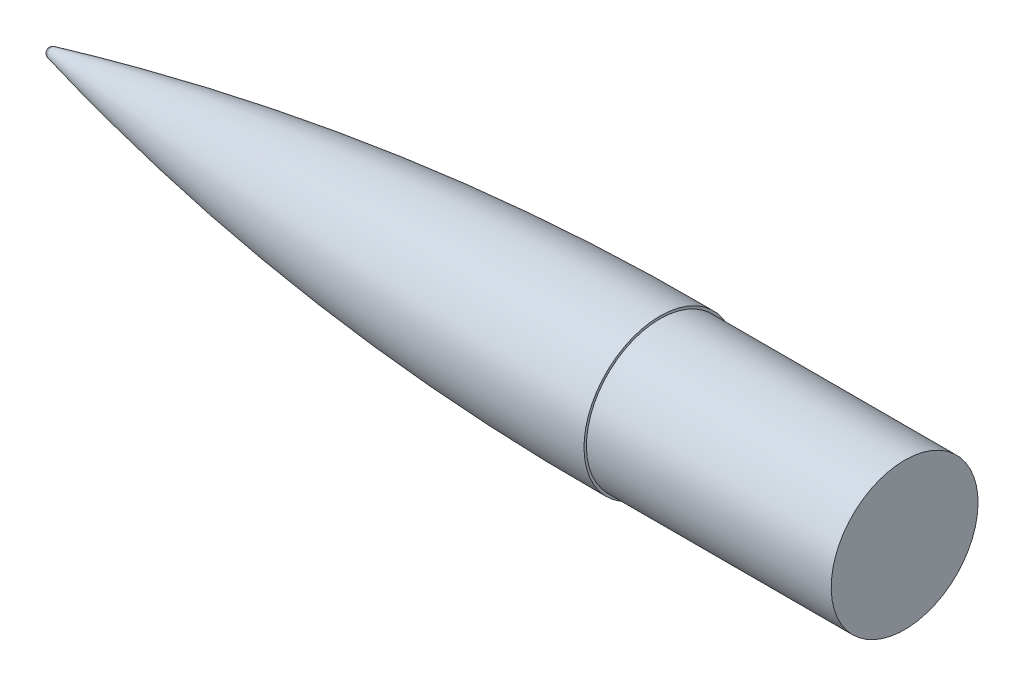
ISO-10303-21;
HEADER;
FILE_DESCRIPTION(('STEP AP214'),'2;1');
FILE_NAME('part.step','',(''),(''),'','','');
FILE_SCHEMA(('AUTOMOTIVE_DESIGN { 1 0 10303 214 1 1 1 1 }'));
ENDSEC;
DATA;
#1=APPLICATION_CONTEXT('core data for automotive mechanical design processes');
#2=APPLICATION_PROTOCOL_DEFINITION('international standard','automotive_design',2000,#1);
#3=PRODUCT_CONTEXT('',#1,'mechanical');
#4=PRODUCT('Part','Part','',(#3));
#5=PRODUCT_RELATED_PRODUCT_CATEGORY('part','',(#4));
#6=PRODUCT_DEFINITION_FORMATION('','',#4);
#7=PRODUCT_DEFINITION_CONTEXT('part definition',#1,'design');
#8=PRODUCT_DEFINITION('design','',#6,#7);
#9=PRODUCT_DEFINITION_SHAPE('','',#8);
#10=(LENGTH_UNIT() NAMED_UNIT(*) SI_UNIT(.MILLI.,.METRE.));
#11=(NAMED_UNIT(*) PLANE_ANGLE_UNIT() SI_UNIT($,.RADIAN.));
#12=(NAMED_UNIT(*) SI_UNIT($,.STERADIAN.) SOLID_ANGLE_UNIT());
#13=UNCERTAINTY_MEASURE_WITH_UNIT(LENGTH_MEASURE(1.E-05),#10,'distance_accuracy_value','');
#14=(GEOMETRIC_REPRESENTATION_CONTEXT(3) GLOBAL_UNCERTAINTY_ASSIGNED_CONTEXT((#13)) GLOBAL_UNIT_ASSIGNED_CONTEXT((#10,
#11,#12)) REPRESENTATION_CONTEXT('',''));
#15=CARTESIAN_POINT('',(0.,0.,0.));
#16=DIRECTION('',(0.,0.,1.));
#17=DIRECTION('',(1.,0.,0.));
#18=AXIS2_PLACEMENT_3D('',#15,#16,#17);
#19=CARTESIAN_POINT('',(317.693317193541,0.,0.));
#20=DIRECTION('',(1.,0.,0.));
#21=DIRECTION('',(0.,1.,0.));
#22=AXIS2_PLACEMENT_3D('',#19,#20,#21);
#23=DEGENERATE_TOROIDAL_SURFACE('',#22,1261.33745347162,1300.73103112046,.F.);
#24=CARTESIAN_POINT('',(9.96412339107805,0.,0.));
#25=DIRECTION('',(1.,0.,0.));
#26=DIRECTION('',(0.,1.,0.));
#27=AXIS2_PLACEMENT_3D('',#24,#25,#26);
#28=CIRCLE('',#27,2.46789491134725);
#29=CARTESIAN_POINT('',(9.96412339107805,2.46789491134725,0.));
#30=VERTEX_POINT('',#29);
#31=EDGE_CURVE('E10',#30,#30,#28,.T.);
#32=ORIENTED_EDGE('',*,*,#31,.T.);
#33=EDGE_LOOP('',(#32));
#34=FACE_BOUND('',#33,.T.);
#35=CARTESIAN_POINT('',(325.525034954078,0.,0.));
#36=DIRECTION('',(1.,0.,0.));
#37=DIRECTION('',(0.,1.,0.));
#38=AXIS2_PLACEMENT_3D('',#35,#36,#37);
#39=CIRCLE('',#38,39.37);
#40=CARTESIAN_POINT('',(325.525034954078,39.37,0.));
#41=VERTEX_POINT('',#40);
#42=EDGE_CURVE('E44',#41,#41,#39,.T.);
#43=ORIENTED_EDGE('',*,*,#42,.F.);
#44=EDGE_LOOP('',(#43));
#45=FACE_BOUND('',#44,.T.);
#46=ADVANCED_FACE('F30',(#34,#45),#23,.F.);
#47=CARTESIAN_POINT('',(10.5650349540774,0.,0.));
#48=DIRECTION('',(1.,0.,0.));
#49=DIRECTION('',(0.,1.,0.));
#50=AXIS2_PLACEMENT_3D('',#47,#48,#49);
#51=SPHERICAL_SURFACE('',#50,2.54);
#52=ORIENTED_EDGE('',*,*,#31,.F.);
#53=EDGE_LOOP('',(#52));
#54=FACE_BOUND('',#53,.T.);
#55=ADVANCED_FACE('F54',(#54),#51,.T.);
#56=CARTESIAN_POINT('',(452.525034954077,38.1,0.));
#57=DIRECTION('',(1.,0.,0.));
#58=DIRECTION('',(0.,1.,0.));
#59=AXIS2_PLACEMENT_3D('',#56,#57,#58);
#60=PLANE('',#59);
#61=CARTESIAN_POINT('',(452.525034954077,0.,0.));
#62=DIRECTION('',(1.,0.,0.));
#63=DIRECTION('',(0.,1.,0.));
#64=AXIS2_PLACEMENT_3D('',#61,#62,#63);
#65=CIRCLE('',#64,38.1);
#66=CARTESIAN_POINT('',(452.525034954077,38.1,0.));
#67=VERTEX_POINT('',#66);
#68=EDGE_CURVE('E36',#67,#67,#65,.T.);
#69=ORIENTED_EDGE('',*,*,#68,.T.);
#70=EDGE_LOOP('',(#69));
#71=FACE_BOUND('',#70,.T.);
#72=ADVANCED_FACE('F58',(#71),#60,.T.);
#73=CARTESIAN_POINT('',(452.525034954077,0.,0.));
#74=DIRECTION('',(1.,0.,0.));
#75=DIRECTION('',(0.,1.,0.));
#76=AXIS2_PLACEMENT_3D('',#73,#74,#75);
#77=CYLINDRICAL_SURFACE('',#76,38.1);
#78=CARTESIAN_POINT('',(325.525034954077,0.,0.));
#79=DIRECTION('',(1.,0.,0.));
#80=DIRECTION('',(0.,1.,0.));
#81=AXIS2_PLACEMENT_3D('',#78,#79,#80);
#82=CIRCLE('',#81,38.1);
#83=CARTESIAN_POINT('',(325.525034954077,38.1,0.));
#84=VERTEX_POINT('',#83);
#85=EDGE_CURVE('E40',#84,#84,#82,.T.);
#86=ORIENTED_EDGE('',*,*,#85,.T.);
#87=EDGE_LOOP('',(#86));
#88=FACE_BOUND('',#87,.T.);
#89=ORIENTED_EDGE('',*,*,#68,.F.);
#90=EDGE_LOOP('',(#89));
#91=FACE_BOUND('',#90,.T.);
#92=ADVANCED_FACE('F63',(#88,#91),#77,.T.);
#93=CARTESIAN_POINT('',(325.525034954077,38.1,0.));
#94=DIRECTION('',(1.,0.,0.));
#95=DIRECTION('',(0.,1.,0.));
#96=AXIS2_PLACEMENT_3D('',#93,#94,#95);
#97=PLANE('',#96);
#98=ORIENTED_EDGE('',*,*,#42,.T.);
#99=EDGE_LOOP('',(#98));
#100=FACE_BOUND('',#99,.T.);
#101=ORIENTED_EDGE('',*,*,#85,.F.);
#102=EDGE_LOOP('',(#101));
#103=FACE_BOUND('',#102,.T.);
#104=ADVANCED_FACE('F50',(#100,#103),#97,.T.);
#105=CLOSED_SHELL('',(#46,#55,#72,#92,#104));
#106=MANIFOLD_SOLID_BREP('B2',#105);
#107=ADVANCED_BREP_SHAPE_REPRESENTATION('',(#18,#106),#14);
#108=SHAPE_DEFINITION_REPRESENTATION(#9,#107);
ENDSEC;
END-ISO-10303-21;
